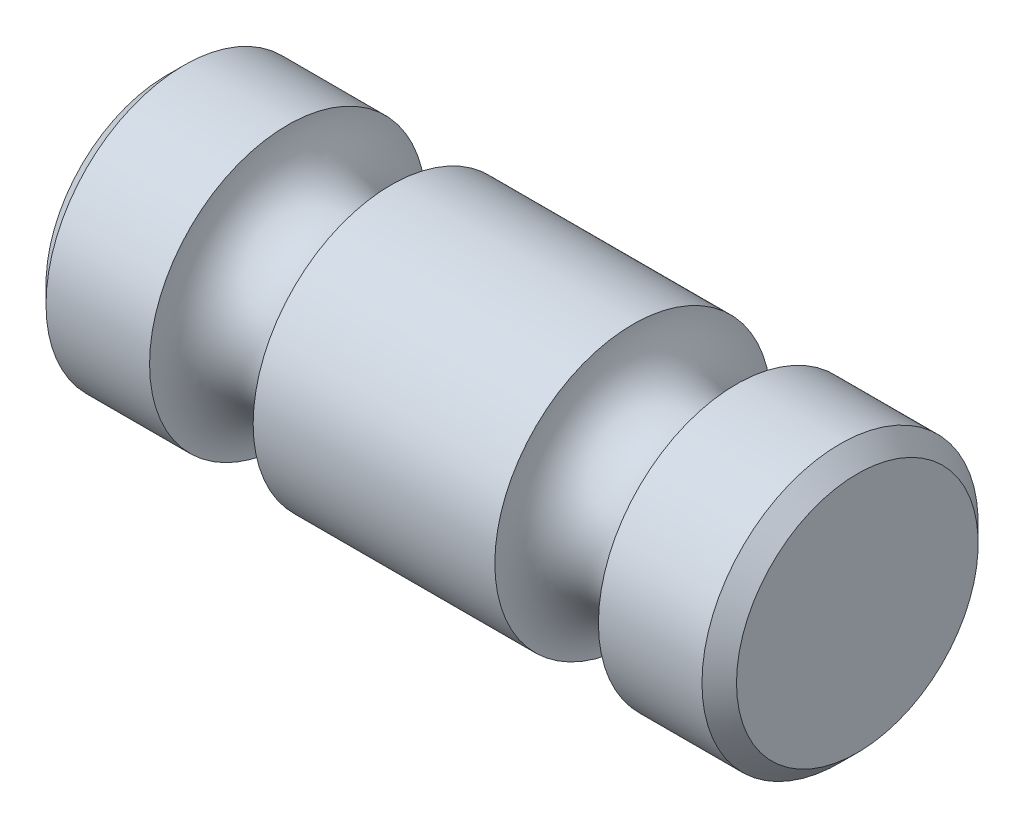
from build123d import *

# Parameters (mm, degrees)
CHANFREIN3_SIZE = 1


with BuildPart() as part:
    # Esquisse1 → R_volution1 (revolve)
    with BuildSketch(Plane.XY, mode=Mode.PRIVATE) as r_volution1_sk:
        with BuildLine():
            Line((-57.310131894, 14.348343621), (-50.310131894, 14.348343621))
            ThreePointArc((-50.310131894, 14.348343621), (-47.310131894, 11.348343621), (-44.310131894, 14.348343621))
            Line((-44.310131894, 14.348343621), (-30.310131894, 14.348343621))
            ThreePointArc((-30.310131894, 14.348343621), (-27.310131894, 11.348343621), (-24.310131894, 14.348343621))
            Line((-24.310131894, 14.348343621), (-17.310131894, 14.348343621))
            Line((-17.310131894, 14.348343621), (-17.310131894, 6.348343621))
            Line((-17.310131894, 6.348343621), (-57.310131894, 6.348343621))
            Line((-57.310131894, 6.348343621), (-57.310131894, 14.348343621))
        make_face()
    revolve(r_volution1_sk.sketch.rotate(Axis((-63.221249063, 6.348343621, 0), (1, 0, 0)), 90), axis=Axis((-63.221249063, 6.348343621, 0), (1, 0, 0)))

    # Chanfrein3
    chanfrein3_edges = [part.edges().sort_by_distance(p)[0] for p in [
        (-57.310131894, 6.348343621, -8),
        (-17.310131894, 6.348343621, -8),
    ]]
    chamfer(chanfrein3_edges, length=CHANFREIN3_SIZE)


solid = part.part
